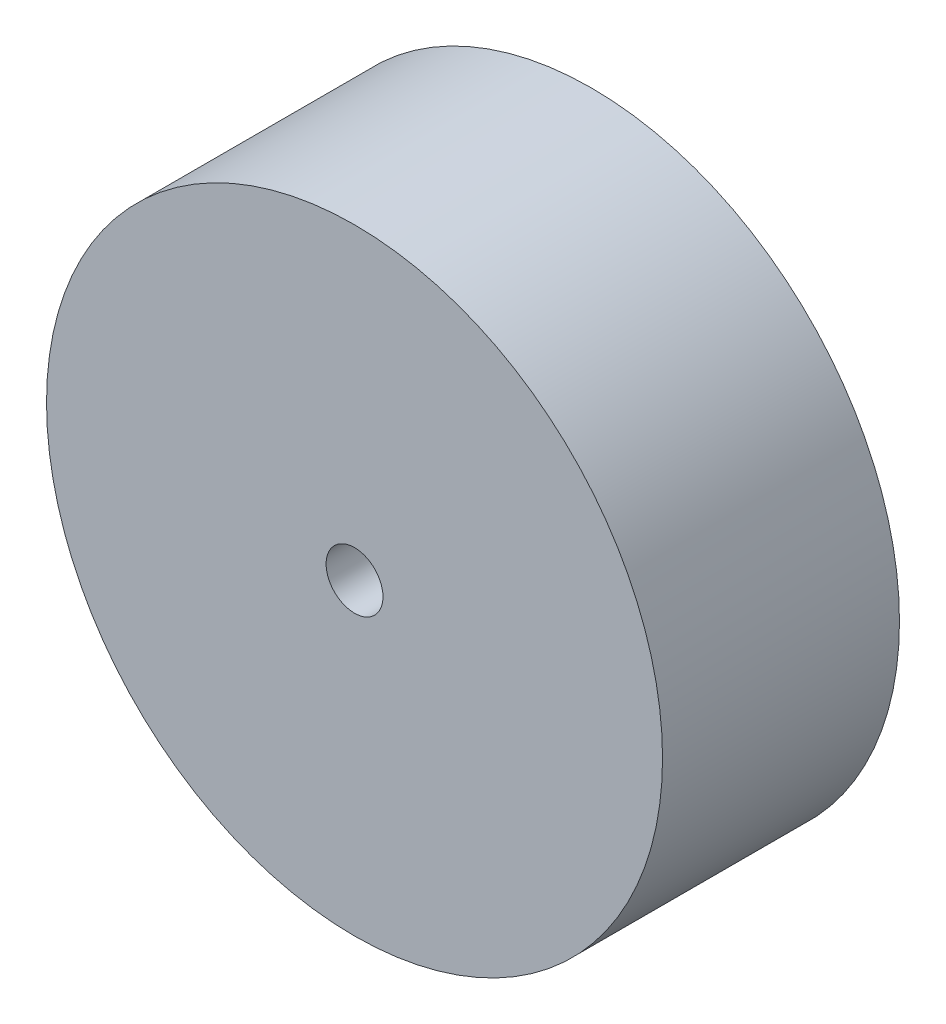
ISO-10303-21;
HEADER;
FILE_DESCRIPTION(('STEP AP214'),'2;1');
FILE_NAME('part.step','',(''),(''),'','','');
FILE_SCHEMA(('AUTOMOTIVE_DESIGN { 1 0 10303 214 1 1 1 1 }'));
ENDSEC;
DATA;
#1=APPLICATION_CONTEXT('core data for automotive mechanical design processes');
#2=APPLICATION_PROTOCOL_DEFINITION('international standard','automotive_design',2000,#1);
#3=PRODUCT_CONTEXT('',#1,'mechanical');
#4=PRODUCT('Part','Part','',(#3));
#5=PRODUCT_RELATED_PRODUCT_CATEGORY('part','',(#4));
#6=PRODUCT_DEFINITION_FORMATION('','',#4);
#7=PRODUCT_DEFINITION_CONTEXT('part definition',#1,'design');
#8=PRODUCT_DEFINITION('design','',#6,#7);
#9=PRODUCT_DEFINITION_SHAPE('','',#8);
#10=(LENGTH_UNIT() NAMED_UNIT(*) SI_UNIT(.MILLI.,.METRE.));
#11=(NAMED_UNIT(*) PLANE_ANGLE_UNIT() SI_UNIT($,.RADIAN.));
#12=(NAMED_UNIT(*) SI_UNIT($,.STERADIAN.) SOLID_ANGLE_UNIT());
#13=UNCERTAINTY_MEASURE_WITH_UNIT(LENGTH_MEASURE(1.E-05),#10,'distance_accuracy_value','');
#14=(GEOMETRIC_REPRESENTATION_CONTEXT(3) GLOBAL_UNCERTAINTY_ASSIGNED_CONTEXT((#13)) GLOBAL_UNIT_ASSIGNED_CONTEXT((#10,
#11,#12)) REPRESENTATION_CONTEXT('',''));
#15=CARTESIAN_POINT('',(0.,0.,0.));
#16=DIRECTION('',(0.,0.,1.));
#17=DIRECTION('',(1.,0.,0.));
#18=AXIS2_PLACEMENT_3D('',#15,#16,#17);
#19=CARTESIAN_POINT('',(0.,0.,25.));
#20=DIRECTION('',(0.,0.,1.));
#21=DIRECTION('',(1.,0.,0.));
#22=AXIS2_PLACEMENT_3D('',#19,#20,#21);
#23=PLANE('',#22);
#24=CARTESIAN_POINT('',(0.,0.,25.));
#25=DIRECTION('',(0.,0.,1.));
#26=DIRECTION('',(1.,0.,0.));
#27=AXIS2_PLACEMENT_3D('',#24,#25,#26);
#28=CIRCLE('',#27,32.5);
#29=CARTESIAN_POINT('',(32.5,0.,25.));
#30=VERTEX_POINT('',#29);
#31=EDGE_CURVE('E10',#30,#30,#28,.T.);
#32=ORIENTED_EDGE('',*,*,#31,.T.);
#33=EDGE_LOOP('',(#32));
#34=FACE_BOUND('',#33,.T.);
#35=CARTESIAN_POINT('',(0.,0.,25.));
#36=DIRECTION('',(0.,0.,1.));
#37=DIRECTION('',(1.,0.,0.));
#38=AXIS2_PLACEMENT_3D('',#35,#36,#37);
#39=CIRCLE('',#38,3.);
#40=CARTESIAN_POINT('',(3.,0.,25.));
#41=VERTEX_POINT('',#40);
#42=EDGE_CURVE('E54',#41,#41,#39,.T.);
#43=ORIENTED_EDGE('',*,*,#42,.F.);
#44=EDGE_LOOP('',(#43));
#45=FACE_BOUND('',#44,.T.);
#46=ADVANCED_FACE('F41',(#34,#45),#23,.T.);
#47=CARTESIAN_POINT('',(0.,0.,0.));
#48=DIRECTION('',(0.,0.,1.));
#49=DIRECTION('',(1.,0.,0.));
#50=AXIS2_PLACEMENT_3D('',#47,#48,#49);
#51=PLANE('',#50);
#52=CARTESIAN_POINT('',(0.,0.,0.));
#53=DIRECTION('',(0.,0.,1.));
#54=DIRECTION('',(1.,0.,0.));
#55=AXIS2_PLACEMENT_3D('',#52,#53,#54);
#56=CIRCLE('',#55,32.5);
#57=CARTESIAN_POINT('',(32.5,0.,0.));
#58=VERTEX_POINT('',#57);
#59=EDGE_CURVE('E45',#58,#58,#56,.T.);
#60=ORIENTED_EDGE('',*,*,#59,.F.);
#61=EDGE_LOOP('',(#60));
#62=FACE_BOUND('',#61,.T.);
#63=CARTESIAN_POINT('',(0.,0.,0.));
#64=DIRECTION('',(0.,0.,1.));
#65=DIRECTION('',(1.,0.,0.));
#66=AXIS2_PLACEMENT_3D('',#63,#64,#65);
#67=CIRCLE('',#66,3.);
#68=CARTESIAN_POINT('',(3.,0.,0.));
#69=VERTEX_POINT('',#68);
#70=EDGE_CURVE('E56',#69,#69,#67,.T.);
#71=ORIENTED_EDGE('',*,*,#70,.T.);
#72=EDGE_LOOP('',(#71));
#73=FACE_BOUND('',#72,.T.);
#74=ADVANCED_FACE('F68',(#62,#73),#51,.F.);
#75=CARTESIAN_POINT('',(0.,0.,25.));
#76=DIRECTION('',(0.,0.,-1.));
#77=DIRECTION('',(-1.,0.,0.));
#78=AXIS2_PLACEMENT_3D('',#75,#76,#77);
#79=CYLINDRICAL_SURFACE('',#78,32.5);
#80=ORIENTED_EDGE('',*,*,#31,.F.);
#81=EDGE_LOOP('',(#80));
#82=FACE_BOUND('',#81,.T.);
#83=ORIENTED_EDGE('',*,*,#59,.T.);
#84=EDGE_LOOP('',(#83));
#85=FACE_BOUND('',#84,.T.);
#86=ADVANCED_FACE('F43',(#82,#85),#79,.T.);
#87=CARTESIAN_POINT('',(0.,0.,25.));
#88=DIRECTION('',(0.,0.,-1.));
#89=DIRECTION('',(-1.,0.,0.));
#90=AXIS2_PLACEMENT_3D('',#87,#88,#89);
#91=CYLINDRICAL_SURFACE('',#90,3.);
#92=ORIENTED_EDGE('',*,*,#42,.T.);
#93=EDGE_LOOP('',(#92));
#94=FACE_BOUND('',#93,.T.);
#95=ORIENTED_EDGE('',*,*,#70,.F.);
#96=EDGE_LOOP('',(#95));
#97=FACE_BOUND('',#96,.T.);
#98=ADVANCED_FACE('F64',(#94,#97),#91,.F.);
#99=CLOSED_SHELL('',(#46,#74,#86,#98));
#100=MANIFOLD_SOLID_BREP('B2',#99);
#101=ADVANCED_BREP_SHAPE_REPRESENTATION('',(#18,#100),#14);
#102=SHAPE_DEFINITION_REPRESENTATION(#9,#101);
ENDSEC;
END-ISO-10303-21;
